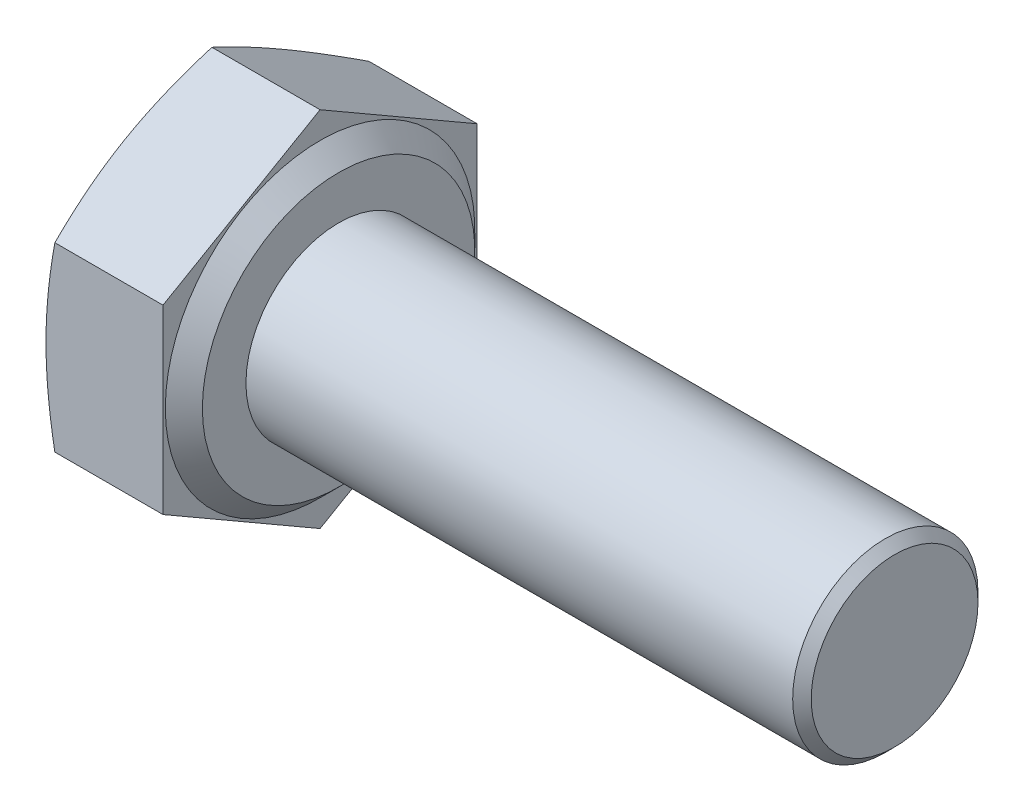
from build123d import *

# Parameters (mm, degrees)
BASEHEAD_DEPTH = 2.925
SKETCH5_R      = 2
BASEBODY_DEPTH = 12
CHAMFER1_SIZE  = 0.2


with BuildPart() as part:
    # Sketch2 → BaseHead (new body)
    with BuildSketch(Plane(origin=(0, 0, 0), x_dir=(0, 0, -1), z_dir=(1, 0, 0))):
        Polygon((3.39, -1.957217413), (3.39, 1.957217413), (0, 3.914434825), (-3.39, 1.957217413), (-3.39, -1.957217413), (0, -3.914434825), align=None)
    extrude(amount=BASEHEAD_DEPTH)

    # Sketch3 → BearingFace (revolve, cut)
    with BuildSketch(Plane.XY, mode=Mode.PRIVATE) as bearingface_sk:
        Polygon((2.925, 3.914434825), (2.925, 2.94), (2.525, 3.34), (2.525, 3.914434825), align=None)
    revolve(bearingface_sk.sketch.rotate(Axis((-0.957090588, 0, 0), (1, 0, 0)), 90), axis=Axis((-0.957090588, 0, 0), (1, 0, 0)), mode=Mode.SUBTRACT)

    # Sketch4 → HeadChamfer (revolve, cut)
    with BuildSketch(Plane.XY):
        Polygon((0, 3.914434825), (0.190878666, 3.914434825), (0, 3.39), align=None)
    revolve(axis=Axis((-0.493528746, 0, 0), (1, 0, 0)), mode=Mode.SUBTRACT)

    # Sketch5 → BaseBody (add)
    with BuildSketch(Plane(origin=(2.925, 0, 0), x_dir=(0, 0, -1), z_dir=(1, 0, 0))):
        Circle(SKETCH5_R)
    extrude(amount=BASEBODY_DEPTH)

    # Chamfer1
    chamfer1_edges = [part.edges().sort_by_distance(p)[0] for p in [
        (14.925, 0, 2),
    ]]
    chamfer(chamfer1_edges, length=CHAMFER1_SIZE)


solid = part.part
